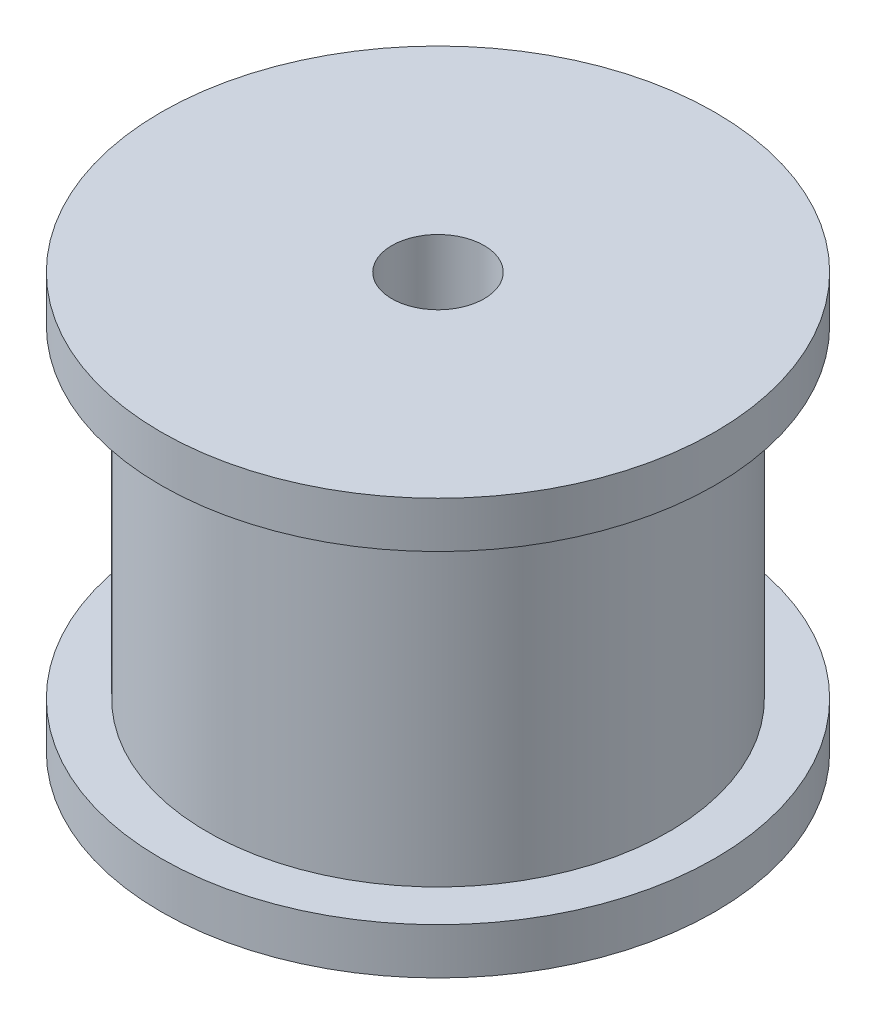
ISO-10303-21;
HEADER;
FILE_DESCRIPTION(('STEP AP214'),'2;1');
FILE_NAME('part.step','',(''),(''),'','','');
FILE_SCHEMA(('AUTOMOTIVE_DESIGN { 1 0 10303 214 1 1 1 1 }'));
ENDSEC;
DATA;
#1=APPLICATION_CONTEXT('core data for automotive mechanical design processes');
#2=APPLICATION_PROTOCOL_DEFINITION('international standard','automotive_design',2000,#1);
#3=PRODUCT_CONTEXT('',#1,'mechanical');
#4=PRODUCT('Part','Part','',(#3));
#5=PRODUCT_RELATED_PRODUCT_CATEGORY('part','',(#4));
#6=PRODUCT_DEFINITION_FORMATION('','',#4);
#7=PRODUCT_DEFINITION_CONTEXT('part definition',#1,'design');
#8=PRODUCT_DEFINITION('design','',#6,#7);
#9=PRODUCT_DEFINITION_SHAPE('','',#8);
#10=(LENGTH_UNIT() NAMED_UNIT(*) SI_UNIT(.MILLI.,.METRE.));
#11=(NAMED_UNIT(*) PLANE_ANGLE_UNIT() SI_UNIT($,.RADIAN.));
#12=(NAMED_UNIT(*) SI_UNIT($,.STERADIAN.) SOLID_ANGLE_UNIT());
#13=UNCERTAINTY_MEASURE_WITH_UNIT(LENGTH_MEASURE(1.E-05),#10,'distance_accuracy_value','');
#14=(GEOMETRIC_REPRESENTATION_CONTEXT(3) GLOBAL_UNCERTAINTY_ASSIGNED_CONTEXT((#13)) GLOBAL_UNIT_ASSIGNED_CONTEXT((#10,
#11,#12)) REPRESENTATION_CONTEXT('',''));
#15=CARTESIAN_POINT('',(0.,0.,0.));
#16=DIRECTION('',(0.,0.,1.));
#17=DIRECTION('',(1.,0.,0.));
#18=AXIS2_PLACEMENT_3D('',#15,#16,#17);
#19=CARTESIAN_POINT('',(6.,0.,0.));
#20=DIRECTION('',(0.,-1.,0.));
#21=DIRECTION('',(0.,0.,-1.));
#22=AXIS2_PLACEMENT_3D('',#19,#20,#21);
#23=PLANE('',#22);
#24=CARTESIAN_POINT('',(0.,0.,0.));
#25=DIRECTION('',(0.,-1.,0.));
#26=DIRECTION('',(0.,0.,-1.));
#27=AXIS2_PLACEMENT_3D('',#24,#25,#26);
#28=CIRCLE('',#27,6.);
#29=CARTESIAN_POINT('',(0.,0.,-6.));
#30=VERTEX_POINT('',#29);
#31=EDGE_CURVE('E82',#30,#30,#28,.T.);
#32=ORIENTED_EDGE('',*,*,#31,.T.);
#33=EDGE_LOOP('',(#32));
#34=FACE_BOUND('',#33,.T.);
#35=CARTESIAN_POINT('',(0.,0.,0.));
#36=DIRECTION('',(0.,-1.,0.));
#37=DIRECTION('',(0.,0.,-1.));
#38=AXIS2_PLACEMENT_3D('',#35,#36,#37);
#39=CIRCLE('',#38,1.);
#40=CARTESIAN_POINT('',(0.,0.,-1.));
#41=VERTEX_POINT('',#40);
#42=EDGE_CURVE('E10',#41,#41,#39,.T.);
#43=ORIENTED_EDGE('',*,*,#42,.F.);
#44=EDGE_LOOP('',(#43));
#45=FACE_BOUND('',#44,.T.);
#46=ADVANCED_FACE('F47',(#34,#45),#23,.T.);
#47=CARTESIAN_POINT('',(0.,0.,0.));
#48=DIRECTION('',(0.,-1.,0.));
#49=DIRECTION('',(0.,0.,-1.));
#50=AXIS2_PLACEMENT_3D('',#47,#48,#49);
#51=CYLINDRICAL_SURFACE('',#50,1.);
#52=ORIENTED_EDGE('',*,*,#42,.T.);
#53=EDGE_LOOP('',(#52));
#54=FACE_BOUND('',#53,.T.);
#55=CARTESIAN_POINT('',(0.,9.,0.));
#56=DIRECTION('',(0.,-1.,0.));
#57=DIRECTION('',(0.,0.,-1.));
#58=AXIS2_PLACEMENT_3D('',#55,#56,#57);
#59=CIRCLE('',#58,1.);
#60=CARTESIAN_POINT('',(0.,9.,-1.));
#61=VERTEX_POINT('',#60);
#62=EDGE_CURVE('E54',#61,#61,#59,.T.);
#63=ORIENTED_EDGE('',*,*,#62,.F.);
#64=EDGE_LOOP('',(#63));
#65=FACE_BOUND('',#64,.T.);
#66=ADVANCED_FACE('F101',(#54,#65),#51,.F.);
#67=CARTESIAN_POINT('',(1.,9.,0.));
#68=DIRECTION('',(0.,1.,0.));
#69=DIRECTION('',(0.,0.,1.));
#70=AXIS2_PLACEMENT_3D('',#67,#68,#69);
#71=PLANE('',#70);
#72=ORIENTED_EDGE('',*,*,#62,.T.);
#73=EDGE_LOOP('',(#72));
#74=FACE_BOUND('',#73,.T.);
#75=CARTESIAN_POINT('',(0.,9.,0.));
#76=DIRECTION('',(0.,-1.,0.));
#77=DIRECTION('',(0.,0.,-1.));
#78=AXIS2_PLACEMENT_3D('',#75,#76,#77);
#79=CIRCLE('',#78,6.);
#80=CARTESIAN_POINT('',(0.,9.,-6.));
#81=VERTEX_POINT('',#80);
#82=EDGE_CURVE('E59',#81,#81,#79,.T.);
#83=ORIENTED_EDGE('',*,*,#82,.F.);
#84=EDGE_LOOP('',(#83));
#85=FACE_BOUND('',#84,.T.);
#86=ADVANCED_FACE('F105',(#74,#85),#71,.T.);
#87=CARTESIAN_POINT('',(0.,0.,0.));
#88=DIRECTION('',(0.,-1.,0.));
#89=DIRECTION('',(0.,0.,-1.));
#90=AXIS2_PLACEMENT_3D('',#87,#88,#89);
#91=CYLINDRICAL_SURFACE('',#90,6.);
#92=ORIENTED_EDGE('',*,*,#82,.T.);
#93=EDGE_LOOP('',(#92));
#94=FACE_BOUND('',#93,.T.);
#95=CARTESIAN_POINT('',(0.,8.,0.));
#96=DIRECTION('',(0.,-1.,0.));
#97=DIRECTION('',(0.,0.,-1.));
#98=AXIS2_PLACEMENT_3D('',#95,#96,#97);
#99=CIRCLE('',#98,6.);
#100=CARTESIAN_POINT('',(0.,8.,-6.));
#101=VERTEX_POINT('',#100);
#102=EDGE_CURVE('E64',#101,#101,#99,.T.);
#103=ORIENTED_EDGE('',*,*,#102,.F.);
#104=EDGE_LOOP('',(#103));
#105=FACE_BOUND('',#104,.T.);
#106=ADVANCED_FACE('F109',(#94,#105),#91,.T.);
#107=CARTESIAN_POINT('',(6.,8.,0.));
#108=DIRECTION('',(0.,-1.,0.));
#109=DIRECTION('',(0.,0.,-1.));
#110=AXIS2_PLACEMENT_3D('',#107,#108,#109);
#111=PLANE('',#110);
#112=ORIENTED_EDGE('',*,*,#102,.T.);
#113=EDGE_LOOP('',(#112));
#114=FACE_BOUND('',#113,.T.);
#115=CARTESIAN_POINT('',(0.,8.,0.));
#116=DIRECTION('',(0.,-1.,0.));
#117=DIRECTION('',(0.,0.,-1.));
#118=AXIS2_PLACEMENT_3D('',#115,#116,#117);
#119=CIRCLE('',#118,5.);
#120=CARTESIAN_POINT('',(0.,8.,-5.));
#121=VERTEX_POINT('',#120);
#122=EDGE_CURVE('E70',#121,#121,#119,.T.);
#123=ORIENTED_EDGE('',*,*,#122,.F.);
#124=EDGE_LOOP('',(#123));
#125=FACE_BOUND('',#124,.T.);
#126=ADVANCED_FACE('F115',(#114,#125),#111,.T.);
#127=CARTESIAN_POINT('',(0.,0.,0.));
#128=DIRECTION('',(0.,-1.,0.));
#129=DIRECTION('',(0.,0.,-1.));
#130=AXIS2_PLACEMENT_3D('',#127,#128,#129);
#131=CYLINDRICAL_SURFACE('',#130,5.);
#132=ORIENTED_EDGE('',*,*,#122,.T.);
#133=EDGE_LOOP('',(#132));
#134=FACE_BOUND('',#133,.T.);
#135=CARTESIAN_POINT('',(0.,0.999999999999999,0.));
#136=DIRECTION('',(0.,-1.,0.));
#137=DIRECTION('',(0.,0.,-1.));
#138=AXIS2_PLACEMENT_3D('',#135,#136,#137);
#139=CIRCLE('',#138,5.);
#140=CARTESIAN_POINT('',(0.,0.999999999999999,-5.));
#141=VERTEX_POINT('',#140);
#142=EDGE_CURVE('E74',#141,#141,#139,.T.);
#143=ORIENTED_EDGE('',*,*,#142,.F.);
#144=EDGE_LOOP('',(#143));
#145=FACE_BOUND('',#144,.T.);
#146=ADVANCED_FACE('F97',(#134,#145),#131,.T.);
#147=CARTESIAN_POINT('',(5.,0.999999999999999,0.));
#148=DIRECTION('',(0.,1.,0.));
#149=DIRECTION('',(0.,0.,1.));
#150=AXIS2_PLACEMENT_3D('',#147,#148,#149);
#151=PLANE('',#150);
#152=ORIENTED_EDGE('',*,*,#142,.T.);
#153=EDGE_LOOP('',(#152));
#154=FACE_BOUND('',#153,.T.);
#155=CARTESIAN_POINT('',(0.,0.999999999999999,0.));
#156=DIRECTION('',(0.,-1.,0.));
#157=DIRECTION('',(0.,0.,-1.));
#158=AXIS2_PLACEMENT_3D('',#155,#156,#157);
#159=CIRCLE('',#158,6.);
#160=CARTESIAN_POINT('',(0.,0.999999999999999,-6.));
#161=VERTEX_POINT('',#160);
#162=EDGE_CURVE('E78',#161,#161,#159,.T.);
#163=ORIENTED_EDGE('',*,*,#162,.F.);
#164=EDGE_LOOP('',(#163));
#165=FACE_BOUND('',#164,.T.);
#166=ADVANCED_FACE('F91',(#154,#165),#151,.T.);
#167=CARTESIAN_POINT('',(0.,0.,0.));
#168=DIRECTION('',(0.,-1.,0.));
#169=DIRECTION('',(0.,0.,-1.));
#170=AXIS2_PLACEMENT_3D('',#167,#168,#169);
#171=CYLINDRICAL_SURFACE('',#170,6.);
#172=ORIENTED_EDGE('',*,*,#162,.T.);
#173=EDGE_LOOP('',(#172));
#174=FACE_BOUND('',#173,.T.);
#175=ORIENTED_EDGE('',*,*,#31,.F.);
#176=EDGE_LOOP('',(#175));
#177=FACE_BOUND('',#176,.T.);
#178=ADVANCED_FACE('F89',(#174,#177),#171,.T.);
#179=CLOSED_SHELL('',(#46,#66,#86,#106,#126,#146,#166,#178));
#180=MANIFOLD_SOLID_BREP('B2',#179);
#181=ADVANCED_BREP_SHAPE_REPRESENTATION('',(#18,#180),#14);
#182=SHAPE_DEFINITION_REPRESENTATION(#9,#181);
ENDSEC;
END-ISO-10303-21;
